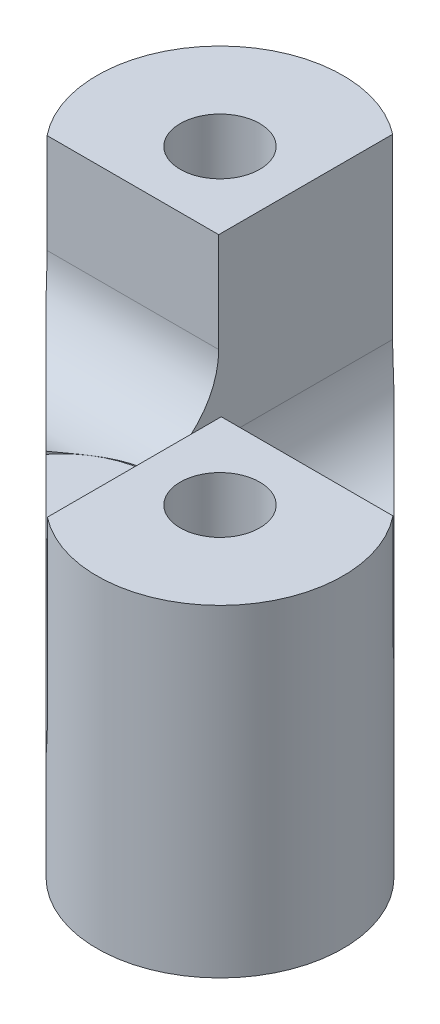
ISO-10303-21;
HEADER;
FILE_DESCRIPTION(('STEP AP214'),'2;1');
FILE_NAME('part.step','',(''),(''),'','','');
FILE_SCHEMA(('AUTOMOTIVE_DESIGN { 1 0 10303 214 1 1 1 1 }'));
ENDSEC;
DATA;
#1=APPLICATION_CONTEXT('core data for automotive mechanical design processes');
#2=APPLICATION_PROTOCOL_DEFINITION('international standard','automotive_design',2000,#1);
#3=PRODUCT_CONTEXT('',#1,'mechanical');
#4=PRODUCT('Part','Part','',(#3));
#5=PRODUCT_RELATED_PRODUCT_CATEGORY('part','',(#4));
#6=PRODUCT_DEFINITION_FORMATION('','',#4);
#7=PRODUCT_DEFINITION_CONTEXT('part definition',#1,'design');
#8=PRODUCT_DEFINITION('design','',#6,#7);
#9=PRODUCT_DEFINITION_SHAPE('','',#8);
#10=(LENGTH_UNIT() NAMED_UNIT(*) SI_UNIT(.MILLI.,.METRE.));
#11=(NAMED_UNIT(*) PLANE_ANGLE_UNIT() SI_UNIT($,.RADIAN.));
#12=(NAMED_UNIT(*) SI_UNIT($,.STERADIAN.) SOLID_ANGLE_UNIT());
#13=UNCERTAINTY_MEASURE_WITH_UNIT(LENGTH_MEASURE(1.E-05),#10,'distance_accuracy_value','');
#14=(GEOMETRIC_REPRESENTATION_CONTEXT(3) GLOBAL_UNCERTAINTY_ASSIGNED_CONTEXT((#13)) GLOBAL_UNIT_ASSIGNED_CONTEXT((#10,
#11,#12)) REPRESENTATION_CONTEXT('',''));
#15=CARTESIAN_POINT('',(0.,0.,0.));
#16=DIRECTION('',(0.,0.,1.));
#17=DIRECTION('',(1.,0.,0.));
#18=AXIS2_PLACEMENT_3D('',#15,#16,#17);
#19=CARTESIAN_POINT('',(0.,13.8,0.));
#20=DIRECTION('',(0.,1.,0.));
#21=DIRECTION('',(0.,0.,1.));
#22=AXIS2_PLACEMENT_3D('',#19,#20,#21);
#23=PLANE('',#22);
#24=CARTESIAN_POINT('',(-6.63999999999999,13.8,-6.63999999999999));
#25=DIRECTION('',(0.,1.,0.));
#26=DIRECTION('',(0.,0.,1.));
#27=AXIS2_PLACEMENT_3D('',#24,#25,#26);
#28=CIRCLE('',#27,1.7);
#29=CARTESIAN_POINT('',(-6.63999999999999,13.8,-8.33999999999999));
#30=VERTEX_POINT('',#29);
#31=EDGE_CURVE('E337',#30,#30,#28,.T.);
#32=ORIENTED_EDGE('',*,*,#31,.F.);
#33=EDGE_LOOP('',(#32));
#34=FACE_BOUND('',#33,.T.);
#35=CARTESIAN_POINT('',(-6.63999999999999,13.8,-6.63999999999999));
#36=DIRECTION('',(0.,1.,0.));
#37=DIRECTION('',(0.,0.,1.));
#38=AXIS2_PLACEMENT_3D('',#35,#36,#37);
#39=CIRCLE('',#38,5.26087445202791);
#40=CARTESIAN_POINT('',(-3.4,13.8,-10.7847798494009));
#41=VERTEX_POINT('',#40);
#42=CARTESIAN_POINT('',(-10.7410150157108,13.8,-3.34477984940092));
#43=VERTEX_POINT('',#42);
#44=EDGE_CURVE('E342',#41,#43,#39,.T.);
#45=ORIENTED_EDGE('',*,*,#44,.T.);
#46=DIRECTION('',(1.,0.,0.));
#47=VECTOR('',#46,1.);
#48=CARTESIAN_POINT('',(0.,13.8,-3.34477984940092));
#49=LINE('',#48,#47);
#50=CARTESIAN_POINT('',(-3.4,13.8,-3.34477984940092));
#51=VERTEX_POINT('',#50);
#52=EDGE_CURVE('E377',#43,#51,#49,.T.);
#53=ORIENTED_EDGE('',*,*,#52,.T.);
#54=DIRECTION('',(0.,0.,1.));
#55=VECTOR('',#54,1.);
#56=CARTESIAN_POINT('',(-3.4,13.8,0.));
#57=LINE('',#56,#55);
#58=EDGE_CURVE('E247',#41,#51,#57,.T.);
#59=ORIENTED_EDGE('',*,*,#58,.F.);
#60=EDGE_LOOP('',(#45,#53,#59));
#61=FACE_BOUND('',#60,.T.);
#62=ADVANCED_FACE('F45',(#34,#61),#23,.T.);
#63=CARTESIAN_POINT('',(3.4,20.8045031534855,-11.9008744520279));
#64=DIRECTION('',(1.,0.,0.));
#65=DIRECTION('',(0.,1.,0.));
#66=AXIS2_PLACEMENT_3D('',#63,#64,#65);
#67=PLANE('',#66);
#68=CARTESIAN_POINT('',(3.4,9.54477984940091,0.));
#69=DIRECTION('',(1.,0.,0.));
#70=DIRECTION('',(0.,1.,0.));
#71=AXIS2_PLACEMENT_3D('',#68,#69,#70);
#72=CIRCLE('',#71,3.34477984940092);
#73=CARTESIAN_POINT('',(3.4,9.54477984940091,3.34477984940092));
#74=VERTEX_POINT('',#73);
#75=CARTESIAN_POINT('',(3.4,6.26480442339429,0.655220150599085));
#76=VERTEX_POINT('',#75);
#77=EDGE_CURVE('E246',#74,#76,#72,.T.);
#78=ORIENTED_EDGE('',*,*,#77,.T.);
#79=DIRECTION('',(0.,1.,0.));
#80=VECTOR('',#79,1.);
#81=CARTESIAN_POINT('',(3.4,6.2,0.655220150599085));
#82=LINE('',#81,#80);
#83=CARTESIAN_POINT('',(3.4,6.2,0.655220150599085));
#84=VERTEX_POINT('',#83);
#85=EDGE_CURVE('E66',#76,#84,#82,.F.);
#86=ORIENTED_EDGE('',*,*,#85,.T.);
#87=DIRECTION('',(0.,0.,1.));
#88=VECTOR('',#87,1.);
#89=CARTESIAN_POINT('',(3.4,6.2,-11.9008744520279));
#90=LINE('',#89,#88);
#91=CARTESIAN_POINT('',(3.4,6.2,10.7847798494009));
#92=VERTEX_POINT('',#91);
#93=EDGE_CURVE('E211',#84,#92,#90,.T.);
#94=ORIENTED_EDGE('',*,*,#93,.T.);
#95=DIRECTION('',(0.,-1.,0.));
#96=VECTOR('',#95,1.);
#97=CARTESIAN_POINT('',(3.4,13.8,10.7847798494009));
#98=LINE('',#97,#96);
#99=CARTESIAN_POINT('',(3.4,13.8,10.7847798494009));
#100=VERTEX_POINT('',#99);
#101=EDGE_CURVE('E199',#92,#100,#98,.F.);
#102=ORIENTED_EDGE('',*,*,#101,.T.);
#103=DIRECTION('',(0.,0.,-1.));
#104=VECTOR('',#103,1.);
#105=CARTESIAN_POINT('',(3.4,13.8,0.));
#106=LINE('',#105,#104);
#107=CARTESIAN_POINT('',(3.4,13.8,3.34477984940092));
#108=VERTEX_POINT('',#107);
#109=EDGE_CURVE('E369',#100,#108,#106,.T.);
#110=ORIENTED_EDGE('',*,*,#109,.T.);
#111=DIRECTION('',(0.,-1.,0.));
#112=VECTOR('',#111,1.);
#113=CARTESIAN_POINT('',(3.4,20.8045031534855,3.34477984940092));
#114=LINE('',#113,#112);
#115=EDGE_CURVE('E288',#108,#74,#114,.T.);
#116=ORIENTED_EDGE('',*,*,#115,.T.);
#117=EDGE_LOOP('',(#78,#86,#94,#102,#110,#116));
#118=FACE_BOUND('',#117,.T.);
#119=ADVANCED_FACE('F233',(#118),#67,.F.);
#120=CARTESIAN_POINT('',(-3.71999999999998,13.8,3.71999999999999));
#121=DIRECTION('',(0.707106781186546,0.,-0.707106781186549));
#122=DIRECTION('',(-0.707106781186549,0.,-0.707106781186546));
#123=AXIS2_PLACEMENT_3D('',#120,#121,#122);
#124=PLANE('',#123);
#125=DIRECTION('',(0.707106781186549,0.,0.707106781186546));
#126=VECTOR('',#125,1.);
#127=CARTESIAN_POINT('',(-3.71999999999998,6.2,3.71999999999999));
#128=LINE('',#127,#126);
#129=CARTESIAN_POINT('',(-6.55459551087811,6.2,0.88540448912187));
#130=VERTEX_POINT('',#129);
#131=CARTESIAN_POINT('',(-3.4,6.2,4.03999999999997));
#132=VERTEX_POINT('',#131);
#133=EDGE_CURVE('E172',#130,#132,#128,.T.);
#134=ORIENTED_EDGE('',*,*,#133,.F.);
#135=DIRECTION('',(0.,1.,0.));
#136=VECTOR('',#135,1.);
#137=CARTESIAN_POINT('',(-6.55459551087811,6.2,0.88540448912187));
#138=LINE('',#137,#136);
#139=CARTESIAN_POINT('',(-6.55459551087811,6.31931691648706,0.885404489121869));
#140=VERTEX_POINT('',#139);
#141=EDGE_CURVE('E193',#130,#140,#138,.T.);
#142=ORIENTED_EDGE('',*,*,#141,.T.);
#143=CARTESIAN_POINT('',(-7.43999999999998,9.54477984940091,0.));
#144=DIRECTION('',(0.707106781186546,0.,-0.707106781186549));
#145=DIRECTION('',(0.707106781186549,0.,0.707106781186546));
#146=AXIS2_PLACEMENT_3D('',#143,#144,#145);
#147=ELLIPSE('',#146,4.73023302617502,3.34477984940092);
#148=CARTESIAN_POINT('',(-10.36,7.91347600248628,-2.91999999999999));
#149=VERTEX_POINT('',#148);
#150=EDGE_CURVE('E269',#140,#149,#147,.T.);
#151=ORIENTED_EDGE('',*,*,#150,.T.);
#152=DIRECTION('',(0.,-1.,0.));
#153=VECTOR('',#152,1.);
#154=CARTESIAN_POINT('',(-10.36,13.8,-2.91999999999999));
#155=LINE('',#154,#153);
#156=CARTESIAN_POINT('',(-10.36,0.,-2.91999999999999));
#157=VERTEX_POINT('',#156);
#158=EDGE_CURVE('E336',#149,#157,#155,.T.);
#159=ORIENTED_EDGE('',*,*,#158,.T.);
#160=DIRECTION('',(0.707106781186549,0.,0.707106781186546));
#161=VECTOR('',#160,1.);
#162=CARTESIAN_POINT('',(-3.71999999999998,0.,3.71999999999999));
#163=LINE('',#162,#161);
#164=CARTESIAN_POINT('',(2.92000000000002,0.,10.36));
#165=VERTEX_POINT('',#164);
#166=EDGE_CURVE('E346',#157,#165,#163,.T.);
#167=ORIENTED_EDGE('',*,*,#166,.T.);
#168=DIRECTION('',(0.,-1.,0.));
#169=VECTOR('',#168,1.);
#170=CARTESIAN_POINT('',(2.92000000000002,13.8,10.36));
#171=LINE('',#170,#169);
#172=CARTESIAN_POINT('',(2.92000000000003,4.45827671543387,10.36));
#173=VERTEX_POINT('',#172);
#174=EDGE_CURVE('E368',#173,#165,#171,.T.);
#175=ORIENTED_EDGE('',*,*,#174,.F.);
#176=CARTESIAN_POINT('',(0.,6.2,7.43999999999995));
#177=DIRECTION('',(0.707106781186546,0.,-0.707106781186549));
#178=DIRECTION('',(0.707106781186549,0.,0.707106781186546));
#179=AXIS2_PLACEMENT_3D('',#176,#177,#178);
#180=ELLIPSE('',#179,4.80832611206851,3.4);
#181=EDGE_CURVE('E223',#173,#132,#180,.T.);
#182=ORIENTED_EDGE('',*,*,#181,.T.);
#183=EDGE_LOOP('',(#134,#142,#151,#159,#167,#175,#182));
#184=FACE_BOUND('',#183,.T.);
#185=ADVANCED_FACE('F47',(#184),#124,.F.);
#186=CARTESIAN_POINT('',(6.64000000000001,13.8,6.63999999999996));
#187=DIRECTION('',(0.,-1.,0.));
#188=DIRECTION('',(0.,0.,-1.));
#189=AXIS2_PLACEMENT_3D('',#186,#187,#188);
#190=CYLINDRICAL_SURFACE('',#189,5.26087445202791);
#191=CARTESIAN_POINT('',(10.7410150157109,9.54477984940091,3.34477984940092));
#192=CARTESIAN_POINT('',(10.7410107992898,9.46982552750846,3.34479476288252));
#193=CARTESIAN_POINT('',(10.7389905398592,9.39487144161,3.34226097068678));
#194=CARTESIAN_POINT('',(10.7308864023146,9.24552323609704,3.33220228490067));
#195=CARTESIAN_POINT('',(10.7248027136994,9.17112909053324,3.32467762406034));
#196=CARTESIAN_POINT('',(10.7087642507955,9.0254878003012,3.30501813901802));
#197=CARTESIAN_POINT('',(10.6989207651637,8.95421042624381,3.29301606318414));
#198=CARTESIAN_POINT('',(10.6753104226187,8.81321013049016,3.26458693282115));
#199=CARTESIAN_POINT('',(10.6615438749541,8.7434870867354,3.24816022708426));
#200=CARTESIAN_POINT('',(10.6302555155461,8.60705840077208,3.21140938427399));
#201=CARTESIAN_POINT('',(10.612790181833,8.54032387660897,3.19114430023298));
#202=CARTESIAN_POINT('',(10.5739400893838,8.40926735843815,3.1468951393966));
#203=CARTESIAN_POINT('',(10.5525550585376,8.34494553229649,3.12291080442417));
#204=CARTESIAN_POINT('',(10.5051742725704,8.21736987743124,3.07089646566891));
#205=CARTESIAN_POINT('',(10.4790663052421,8.15419621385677,3.04277208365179));
#206=CARTESIAN_POINT('',(10.4226690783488,8.03121612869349,2.98351508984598));
#207=CARTESIAN_POINT('',(10.3923798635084,7.97140967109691,2.95238251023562));
#208=CARTESIAN_POINT('',(10.36,7.91347600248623,2.91999999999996));
#209=B_SPLINE_CURVE_WITH_KNOTS('',3,(#191,#192,#193,#194,#195,#196,#197,#198,#199,#200,#201,
#202,#203,#204,#205,#206,#207,#208),.UNSPECIFIED.,.F.,.F.,(4,2,2,2,2,2,2,2,4),(0.,
0.2247932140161,0.449575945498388,0.668164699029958,0.886736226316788,1.1021841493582,
1.31764703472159,1.53913516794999,1.76062093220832),.UNSPECIFIED.);
#210=CARTESIAN_POINT('',(10.7410150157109,9.54477984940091,3.34477984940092));
#211=VERTEX_POINT('',#210);
#212=CARTESIAN_POINT('',(10.36,7.91347600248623,2.91999999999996));
#213=VERTEX_POINT('',#212);
#214=EDGE_CURVE('E205',#211,#213,#209,.T.);
#215=ORIENTED_EDGE('',*,*,#214,.F.);
#216=DIRECTION('',(0.,-1.,0.));
#217=VECTOR('',#216,1.);
#218=CARTESIAN_POINT('',(10.7410150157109,13.8,3.34477984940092));
#219=LINE('',#218,#217);
#220=CARTESIAN_POINT('',(10.7410150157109,13.8,3.34477984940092));
#221=VERTEX_POINT('',#220);
#222=EDGE_CURVE('E386',#221,#211,#219,.T.);
#223=ORIENTED_EDGE('',*,*,#222,.F.);
#224=CARTESIAN_POINT('',(6.64000000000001,13.8,6.63999999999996));
#225=DIRECTION('',(0.,1.,0.));
#226=DIRECTION('',(0.,0.,1.));
#227=AXIS2_PLACEMENT_3D('',#224,#225,#226);
#228=CIRCLE('',#227,5.26087445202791);
#229=EDGE_CURVE('E363',#221,#100,#228,.F.);
#230=ORIENTED_EDGE('',*,*,#229,.T.);
#231=ORIENTED_EDGE('',*,*,#101,.F.);
#232=CARTESIAN_POINT('',(2.92000000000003,4.45827671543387,10.36));
#233=CARTESIAN_POINT('',(2.95512823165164,4.51713729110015,10.3951267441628));
#234=CARTESIAN_POINT('',(2.98903317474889,4.57805637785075,10.4280376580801));
#235=CARTESIAN_POINT('',(3.05381738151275,4.70361760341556,10.4894271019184));
#236=CARTESIAN_POINT('',(3.08469678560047,4.76825956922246,10.5179058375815));
#237=CARTESIAN_POINT('',(3.14201297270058,4.89895988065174,10.5696736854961));
#238=CARTESIAN_POINT('',(3.16855243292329,4.96492315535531,10.5930890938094));
#239=CARTESIAN_POINT('',(3.21778980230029,5.09956130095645,10.635790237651));
#240=CARTESIAN_POINT('',(3.24048780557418,5.16823610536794,10.655076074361));
#241=CARTESIAN_POINT('',(3.2832909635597,5.31334183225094,10.6909439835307));
#242=CARTESIAN_POINT('',(3.30305077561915,5.38995746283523,10.7071931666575));
#243=CARTESIAN_POINT('',(3.33729732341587,5.5451954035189,10.7350505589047));
#244=CARTESIAN_POINT('',(3.35178323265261,5.62381802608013,10.7466580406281));
#245=CARTESIAN_POINT('',(3.3755863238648,5.78496817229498,10.7656098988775));
#246=CARTESIAN_POINT('',(3.38472260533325,5.86754001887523,10.7728054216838));
#247=CARTESIAN_POINT('',(3.39693995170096,6.03340791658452,10.7823870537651));
#248=CARTESIAN_POINT('',(3.40002097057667,6.11670397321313,10.7847731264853));
#249=CARTESIAN_POINT('',(3.40000000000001,6.19999999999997,10.7847798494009));
#250=B_SPLINE_CURVE_WITH_KNOTS('',3,(#232,#233,#234,#235,#236,#237,#238,#239,#240,#241,#242,
#243,#244,#245,#246,#247,#248,#249),.UNSPECIFIED.,.F.,.F.,(4,2,2,2,2,2,2,2,4),(0.,
0.231007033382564,0.46200334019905,0.686317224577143,0.910625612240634,1.15261256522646,
1.3946374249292,1.64443358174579,1.89423163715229),.UNSPECIFIED.);
#251=EDGE_CURVE('E216',#173,#92,#250,.T.);
#252=ORIENTED_EDGE('',*,*,#251,.F.);
#253=ORIENTED_EDGE('',*,*,#174,.T.);
#254=CARTESIAN_POINT('',(6.64000000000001,0.,6.63999999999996));
#255=DIRECTION('',(0.,1.,0.));
#256=DIRECTION('',(0.,0.,1.));
#257=AXIS2_PLACEMENT_3D('',#254,#255,#256);
#258=CIRCLE('',#257,5.26087445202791);
#259=CARTESIAN_POINT('',(10.36,0.,2.91999999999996));
#260=VERTEX_POINT('',#259);
#261=EDGE_CURVE('E349',#260,#165,#258,.F.);
#262=ORIENTED_EDGE('',*,*,#261,.F.);
#263=DIRECTION('',(0.,-1.,0.));
#264=VECTOR('',#263,1.);
#265=CARTESIAN_POINT('',(10.36,13.8,2.91999999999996));
#266=LINE('',#265,#264);
#267=EDGE_CURVE('E366',#213,#260,#266,.T.);
#268=ORIENTED_EDGE('',*,*,#267,.F.);
#269=EDGE_LOOP('',(#215,#223,#230,#231,#252,#253,#262,#268));
#270=FACE_BOUND('',#269,.T.);
#271=ADVANCED_FACE('F225',(#270),#190,.T.);
#272=CARTESIAN_POINT('',(3.72,13.8,-3.72000000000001));
#273=DIRECTION('',(0.707106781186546,0.,-0.707106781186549));
#274=DIRECTION('',(-0.707106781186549,0.,-0.707106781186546));
#275=AXIS2_PLACEMENT_3D('',#272,#273,#274);
#276=PLANE('',#275);
#277=DIRECTION('',(0.,1.,0.));
#278=VECTOR('',#277,1.);
#279=CARTESIAN_POINT('',(6.55459551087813,6.2,-0.885404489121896));
#280=LINE('',#279,#278);
#281=CARTESIAN_POINT('',(6.55459551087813,6.31931691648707,-0.885404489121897));
#282=VERTEX_POINT('',#281);
#283=CARTESIAN_POINT('',(6.55459551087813,6.2,-0.885404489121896));
#284=VERTEX_POINT('',#283);
#285=EDGE_CURVE('E405',#282,#284,#280,.F.);
#286=ORIENTED_EDGE('',*,*,#285,.F.);
#287=CARTESIAN_POINT('',(7.44000000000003,9.54477984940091,0.));
#288=DIRECTION('',(0.707106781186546,0.,-0.707106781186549));
#289=DIRECTION('',(0.707106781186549,0.,0.707106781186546));
#290=AXIS2_PLACEMENT_3D('',#287,#288,#289);
#291=ELLIPSE('',#290,4.73023302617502,3.34477984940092);
#292=EDGE_CURVE('E403',#213,#282,#291,.T.);
#293=ORIENTED_EDGE('',*,*,#292,.F.);
#294=ORIENTED_EDGE('',*,*,#267,.T.);
#295=DIRECTION('',(0.707106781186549,0.,0.707106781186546));
#296=VECTOR('',#295,1.);
#297=CARTESIAN_POINT('',(3.72,0.,-3.72000000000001));
#298=LINE('',#297,#296);
#299=CARTESIAN_POINT('',(-2.92,0.,-10.36));
#300=VERTEX_POINT('',#299);
#301=EDGE_CURVE('E352',#300,#260,#298,.T.);
#302=ORIENTED_EDGE('',*,*,#301,.F.);
#303=DIRECTION('',(0.,-1.,0.));
#304=VECTOR('',#303,1.);
#305=CARTESIAN_POINT('',(-2.92,13.8,-10.36));
#306=LINE('',#305,#304);
#307=CARTESIAN_POINT('',(-2.92,4.45827671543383,-10.36));
#308=VERTEX_POINT('',#307);
#309=EDGE_CURVE('E339',#308,#300,#306,.T.);
#310=ORIENTED_EDGE('',*,*,#309,.F.);
#311=CARTESIAN_POINT('',(0.,6.2,-7.44));
#312=DIRECTION('',(0.707106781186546,0.,-0.707106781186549));
#313=DIRECTION('',(0.707106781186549,0.,0.707106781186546));
#314=AXIS2_PLACEMENT_3D('',#311,#312,#313);
#315=ELLIPSE('',#314,4.80832611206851,3.4);
#316=CARTESIAN_POINT('',(3.4,6.2,-4.04000000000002));
#317=VERTEX_POINT('',#316);
#318=EDGE_CURVE('E214',#317,#308,#315,.T.);
#319=ORIENTED_EDGE('',*,*,#318,.F.);
#320=DIRECTION('',(0.707106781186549,0.,0.707106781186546));
#321=VECTOR('',#320,1.);
#322=CARTESIAN_POINT('',(3.72,6.2,-3.72000000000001));
#323=LINE('',#322,#321);
#324=EDGE_CURVE('E412',#317,#284,#323,.T.);
#325=ORIENTED_EDGE('',*,*,#324,.T.);
#326=EDGE_LOOP('',(#286,#293,#294,#302,#310,#319,#325));
#327=FACE_BOUND('',#326,.T.);
#328=ADVANCED_FACE('F258',(#327),#276,.T.);
#329=CARTESIAN_POINT('',(-6.63999999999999,13.8,-6.63999999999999));
#330=DIRECTION('',(0.,-1.,0.));
#331=DIRECTION('',(0.,0.,-1.));
#332=AXIS2_PLACEMENT_3D('',#329,#330,#331);
#333=CYLINDRICAL_SURFACE('',#332,1.7);
#334=CARTESIAN_POINT('',(-6.63999999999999,0.,-6.63999999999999));
#335=DIRECTION('',(0.,1.,0.));
#336=DIRECTION('',(0.,0.,1.));
#337=AXIS2_PLACEMENT_3D('',#334,#335,#336);
#338=CIRCLE('',#337,1.7);
#339=CARTESIAN_POINT('',(-6.63999999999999,0.,-8.33999999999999));
#340=VERTEX_POINT('',#339);
#341=EDGE_CURVE('E358',#340,#340,#338,.T.);
#342=CARTESIAN_POINT('',(-6.63999999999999,13.8,-8.33999999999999));
#343=CARTESIAN_POINT('',(-6.63999999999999,13.65625,-8.33999999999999));
#344=CARTESIAN_POINT('',(-6.63999999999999,13.5125,-8.33999999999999));
#345=CARTESIAN_POINT('',(-6.63999999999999,13.225,-8.33999999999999));
#346=CARTESIAN_POINT('',(-6.63999999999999,13.08125,-8.33999999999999));
#347=CARTESIAN_POINT('',(-6.63999999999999,12.79375,-8.33999999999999));
#348=CARTESIAN_POINT('',(-6.63999999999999,12.65,-8.33999999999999));
#349=CARTESIAN_POINT('',(-6.63999999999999,12.3625,-8.33999999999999));
#350=CARTESIAN_POINT('',(-6.63999999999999,12.21875,-8.33999999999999));
#351=CARTESIAN_POINT('',(-6.63999999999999,11.93125,-8.33999999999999));
#352=CARTESIAN_POINT('',(-6.63999999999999,11.7875,-8.33999999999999));
#353=CARTESIAN_POINT('',(-6.63999999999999,11.5,-8.33999999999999));
#354=CARTESIAN_POINT('',(-6.63999999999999,11.35625,-8.33999999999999));
#355=CARTESIAN_POINT('',(-6.63999999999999,11.06875,-8.33999999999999));
#356=CARTESIAN_POINT('',(-6.63999999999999,10.925,-8.33999999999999));
#357=CARTESIAN_POINT('',(-6.63999999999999,10.6375,-8.33999999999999));
#358=CARTESIAN_POINT('',(-6.63999999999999,10.49375,-8.33999999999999));
#359=CARTESIAN_POINT('',(-6.63999999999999,10.20625,-8.33999999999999));
#360=CARTESIAN_POINT('',(-6.63999999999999,10.0625,-8.33999999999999));
#361=CARTESIAN_POINT('',(-6.63999999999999,9.775,-8.33999999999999));
#362=CARTESIAN_POINT('',(-6.63999999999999,9.63125,-8.33999999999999));
#363=CARTESIAN_POINT('',(-6.63999999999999,9.34375,-8.33999999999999));
#364=CARTESIAN_POINT('',(-6.63999999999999,9.2,-8.33999999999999));
#365=CARTESIAN_POINT('',(-6.63999999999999,8.9125,-8.33999999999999));
#366=CARTESIAN_POINT('',(-6.63999999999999,8.76875,-8.33999999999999));
#367=CARTESIAN_POINT('',(-6.63999999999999,8.48125,-8.33999999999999));
#368=CARTESIAN_POINT('',(-6.63999999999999,8.3375,-8.33999999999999));
#369=CARTESIAN_POINT('',(-6.63999999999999,8.05,-8.33999999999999));
#370=CARTESIAN_POINT('',(-6.63999999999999,7.90625,-8.33999999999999));
#371=CARTESIAN_POINT('',(-6.63999999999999,7.61875,-8.33999999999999));
#372=CARTESIAN_POINT('',(-6.63999999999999,7.475,-8.33999999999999));
#373=CARTESIAN_POINT('',(-6.63999999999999,7.1875,-8.33999999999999));
#374=CARTESIAN_POINT('',(-6.63999999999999,7.04375,-8.33999999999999));
#375=CARTESIAN_POINT('',(-6.63999999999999,6.75625,-8.33999999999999));
#376=CARTESIAN_POINT('',(-6.63999999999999,6.6125,-8.33999999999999));
#377=CARTESIAN_POINT('',(-6.63999999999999,6.325,-8.33999999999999));
#378=CARTESIAN_POINT('',(-6.63999999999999,6.18125,-8.33999999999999));
#379=CARTESIAN_POINT('',(-6.63999999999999,5.89375,-8.33999999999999));
#380=CARTESIAN_POINT('',(-6.63999999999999,5.75,-8.33999999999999));
#381=CARTESIAN_POINT('',(-6.63999999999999,5.4625,-8.33999999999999));
#382=CARTESIAN_POINT('',(-6.63999999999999,5.31875,-8.33999999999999));
#383=CARTESIAN_POINT('',(-6.63999999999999,5.03125,-8.33999999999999));
#384=CARTESIAN_POINT('',(-6.63999999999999,4.8875,-8.33999999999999));
#385=CARTESIAN_POINT('',(-6.63999999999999,4.6,-8.33999999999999));
#386=CARTESIAN_POINT('',(-6.63999999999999,4.45625,-8.33999999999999));
#387=CARTESIAN_POINT('',(-6.63999999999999,4.16875,-8.33999999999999));
#388=CARTESIAN_POINT('',(-6.63999999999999,4.025,-8.33999999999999));
#389=CARTESIAN_POINT('',(-6.63999999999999,3.7375,-8.33999999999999));
#390=CARTESIAN_POINT('',(-6.63999999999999,3.59375,-8.33999999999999));
#391=CARTESIAN_POINT('',(-6.63999999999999,3.30625,-8.33999999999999));
#392=CARTESIAN_POINT('',(-6.63999999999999,3.1625,-8.33999999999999));
#393=CARTESIAN_POINT('',(-6.63999999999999,2.875,-8.33999999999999));
#394=CARTESIAN_POINT('',(-6.63999999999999,2.73125,-8.33999999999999));
#395=CARTESIAN_POINT('',(-6.63999999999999,2.44375,-8.33999999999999));
#396=CARTESIAN_POINT('',(-6.63999999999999,2.3,-8.33999999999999));
#397=CARTESIAN_POINT('',(-6.63999999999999,2.0125,-8.33999999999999));
#398=CARTESIAN_POINT('',(-6.63999999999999,1.86875,-8.33999999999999));
#399=CARTESIAN_POINT('',(-6.63999999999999,1.58125,-8.33999999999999));
#400=CARTESIAN_POINT('',(-6.63999999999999,1.4375,-8.33999999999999));
#401=CARTESIAN_POINT('',(-6.63999999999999,1.15,-8.33999999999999));
#402=CARTESIAN_POINT('',(-6.63999999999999,1.00625,-8.33999999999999));
#403=CARTESIAN_POINT('',(-6.63999999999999,0.71875,-8.33999999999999));
#404=CARTESIAN_POINT('',(-6.63999999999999,0.575,-8.33999999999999));
#405=CARTESIAN_POINT('',(-6.63999999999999,0.2875,-8.33999999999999));
#406=CARTESIAN_POINT('',(-6.63999999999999,0.14375,-8.33999999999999));
#407=CARTESIAN_POINT('',(-6.63999999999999,0.,-8.33999999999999));
#408=B_SPLINE_CURVE_WITH_KNOTS('',3,(#342,#343,#344,#345,#346,#347,#348,#349,#350,#351,#352,
#353,#354,#355,#356,#357,#358,#359,#360,#361,#362,#363,#364,#365,#366,#367,#368,#369,#370,#371,
#372,#373,#374,#375,#376,#377,#378,#379,#380,#381,#382,#383,#384,#385,#386,#387,#388,#389,#390,
#391,#392,#393,#394,#395,#396,#397,#398,#399,#400,#401,#402,#403,#404,#405,#406,#407),
.UNSPECIFIED.,.F.,.F.,(4,2,2,2,2,2,2,2,2,2,2,2,2,2,2,2,2,2,2,2,2,2,2,2,2,2,2,2,2,2,2,2,4),(0.,
0.431249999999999,0.862499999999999,1.29375,1.725,2.15625,2.5875,3.01875,3.45,3.88125,4.3125,
4.74375,5.175,5.60625,6.0375,6.46875,6.9,7.33125,7.7625,8.19375,8.625,9.05625,9.4875,9.91875,
10.35,10.78125,11.2125,11.64375,12.075,12.50625,12.9375,13.36875,13.8),.UNSPECIFIED.);
#409=EDGE_CURVE('BSEAM255',#30,#340,#408,.T.);
#410=ORIENTED_EDGE('',*,*,#31,.T.);
#411=ORIENTED_EDGE('',*,*,#341,.F.);
#412=ORIENTED_EDGE('',*,*,#409,.T.);
#413=ORIENTED_EDGE('',*,*,#409,.F.);
#414=EDGE_LOOP('',(#410,#412,#411,#413));
#415=FACE_BOUND('',#414,.T.);
#416=ADVANCED_FACE('F255',(#415),#333,.F.);
#417=CARTESIAN_POINT('',(-6.63999999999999,13.8,-6.63999999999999));
#418=DIRECTION('',(0.,-1.,0.));
#419=DIRECTION('',(0.,0.,-1.));
#420=AXIS2_PLACEMENT_3D('',#417,#418,#419);
#421=CYLINDRICAL_SURFACE('',#420,5.26087445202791);
#422=ORIENTED_EDGE('',*,*,#158,.F.);
#423=CARTESIAN_POINT('',(-10.36,7.91347600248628,-2.91999999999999));
#424=CARTESIAN_POINT('',(-10.3928825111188,7.97230782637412,-2.95288540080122));
#425=CARTESIAN_POINT('',(-10.4236085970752,8.0330718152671,-2.98448110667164));
#426=CARTESIAN_POINT('',(-10.480749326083,8.15806758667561,-3.04456266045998));
#427=CARTESIAN_POINT('',(-10.5071638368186,8.22229947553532,-3.0730484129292));
#428=CARTESIAN_POINT('',(-10.5550111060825,8.35201527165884,-3.12564138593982));
#429=CARTESIAN_POINT('',(-10.5765612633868,8.41741566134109,-3.14984777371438));
#430=CARTESIAN_POINT('',(-10.6156240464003,8.55068101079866,-3.19440975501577));
#431=CARTESIAN_POINT('',(-10.6331370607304,8.61854573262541,-3.21476571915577));
#432=CARTESIAN_POINT('',(-10.6639416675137,8.75521941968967,-3.25101027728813));
#433=CARTESIAN_POINT('',(-10.6772942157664,8.82399766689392,-3.26696294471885));
#434=CARTESIAN_POINT('',(-10.7001947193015,8.96303908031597,-3.29456453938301));
#435=CARTESIAN_POINT('',(-10.7097424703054,9.03330232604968,-3.30621323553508));
#436=CARTESIAN_POINT('',(-10.7252952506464,9.17680956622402,-3.32528615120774));
#437=CARTESIAN_POINT('',(-10.7311939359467,9.25008201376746,-3.33258335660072));
#438=CARTESIAN_POINT('',(-10.7390519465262,9.3971628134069,-3.34233735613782));
#439=CARTESIAN_POINT('',(-10.7410110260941,9.47097119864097,-3.34479384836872));
#440=CARTESIAN_POINT('',(-10.7410150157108,9.54477984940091,-3.34477984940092));
#441=B_SPLINE_CURVE_WITH_KNOTS('',3,(#423,#424,#425,#426,#427,#428,#429,#430,#431,#432,#433,
#434,#435,#436,#437,#438,#439,#440),.UNSPECIFIED.,.F.,.F.,(4,2,2,2,2,2,2,2,4),(0.,
0.224919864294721,0.449846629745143,0.668563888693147,0.887260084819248,1.10258246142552,
1.31791639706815,1.53926184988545,1.76062110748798),.UNSPECIFIED.);
#442=CARTESIAN_POINT('',(-10.7410150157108,9.54477984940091,-3.34477984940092));
#443=VERTEX_POINT('',#442);
#444=EDGE_CURVE('E261',#149,#443,#441,.T.);
#445=ORIENTED_EDGE('',*,*,#444,.T.);
#446=DIRECTION('',(0.,-1.,0.));
#447=VECTOR('',#446,1.);
#448=CARTESIAN_POINT('',(-10.7410150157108,13.8,-3.34477984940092));
#449=LINE('',#448,#447);
#450=EDGE_CURVE('E380',#43,#443,#449,.T.);
#451=ORIENTED_EDGE('',*,*,#450,.F.);
#452=ORIENTED_EDGE('',*,*,#44,.F.);
#453=DIRECTION('',(0.,-1.,0.));
#454=VECTOR('',#453,1.);
#455=CARTESIAN_POINT('',(-3.4,13.8,-10.7847798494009));
#456=LINE('',#455,#454);
#457=CARTESIAN_POINT('',(-3.4,6.2,-10.7847798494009));
#458=VERTEX_POINT('',#457);
#459=EDGE_CURVE('E201',#41,#458,#456,.T.);
#460=ORIENTED_EDGE('',*,*,#459,.T.);
#461=CARTESIAN_POINT('',(-3.4,6.2,-10.7847798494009));
#462=CARTESIAN_POINT('',(-3.4000151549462,6.12302503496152,-10.7847747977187));
#463=CARTESIAN_POINT('',(-3.39738659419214,6.04605028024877,-10.7827363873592));
#464=CARTESIAN_POINT('',(-3.38695047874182,5.89267920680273,-10.7745556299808));
#465=CARTESIAN_POINT('',(-3.37914341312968,5.8162828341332,-10.7684136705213));
#466=CARTESIAN_POINT('',(-3.35875749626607,5.66682251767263,-10.7522258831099));
#467=CARTESIAN_POINT('',(-3.34632302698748,5.59372606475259,-10.7422979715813));
#468=CARTESIAN_POINT('',(-3.31686989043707,5.44912245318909,-10.718476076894));
#469=CARTESIAN_POINT('',(-3.29985128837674,5.37761527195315,-10.7045821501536));
#470=CARTESIAN_POINT('',(-3.25995741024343,5.23103221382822,-10.6714806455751));
#471=CARTESIAN_POINT('',(-3.2367219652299,5.15612988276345,-10.6519363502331));
#472=CARTESIAN_POINT('',(-3.18565339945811,5.00934675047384,-10.6080501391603));
#473=CARTESIAN_POINT('',(-3.15781948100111,4.93746647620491,-10.5837073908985));
#474=CARTESIAN_POINT('',(-3.09713548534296,4.7950358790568,-10.5292961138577));
#475=CARTESIAN_POINT('',(-3.06415280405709,4.72460280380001,-10.4990685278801));
#476=CARTESIAN_POINT('',(-2.99459222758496,4.5880668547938,-10.4334262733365));
#477=CARTESIAN_POINT('',(-2.95801453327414,4.52196373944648,-10.3980118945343));
#478=CARTESIAN_POINT('',(-2.92,4.45827671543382,-10.36));
#479=B_SPLINE_CURVE_WITH_KNOTS('',3,(#461,#462,#463,#464,#465,#466,#467,#468,#469,#470,#471,
#472,#473,#474,#475,#476,#477,#478),.UNSPECIFIED.,.F.,.F.,(4,2,2,2,2,2,2,2,4),(0.,
0.230853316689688,0.46168483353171,0.685847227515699,0.910006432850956,1.15213804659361,
1.39431170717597,1.64427908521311,1.89423250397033),.UNSPECIFIED.);
#480=EDGE_CURVE('E198',#458,#308,#479,.T.);
#481=ORIENTED_EDGE('',*,*,#480,.T.);
#482=ORIENTED_EDGE('',*,*,#309,.T.);
#483=CARTESIAN_POINT('',(-6.63999999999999,0.,-6.63999999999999));
#484=DIRECTION('',(0.,1.,0.));
#485=DIRECTION('',(0.,0.,1.));
#486=AXIS2_PLACEMENT_3D('',#483,#484,#485);
#487=CIRCLE('',#486,5.26087445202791);
#488=EDGE_CURVE('E355',#300,#157,#487,.T.);
#489=ORIENTED_EDGE('',*,*,#488,.T.);
#490=EDGE_LOOP('',(#422,#445,#451,#452,#460,#481,#482,#489));
#491=FACE_BOUND('',#490,.T.);
#492=ADVANCED_FACE('F250',(#491),#421,.T.);
#493=CARTESIAN_POINT('',(6.64000000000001,13.8,6.63999999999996));
#494=DIRECTION('',(0.,-1.,0.));
#495=DIRECTION('',(0.,0.,-1.));
#496=AXIS2_PLACEMENT_3D('',#493,#494,#495);
#497=CYLINDRICAL_SURFACE('',#496,1.7);
#498=CARTESIAN_POINT('',(6.64000000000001,13.8,6.63999999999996));
#499=DIRECTION('',(0.,1.,0.));
#500=DIRECTION('',(0.,0.,1.));
#501=AXIS2_PLACEMENT_3D('',#498,#499,#500);
#502=CIRCLE('',#501,1.7);
#503=CARTESIAN_POINT('',(6.64000000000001,13.8,4.93999999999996));
#504=VERTEX_POINT('',#503);
#505=EDGE_CURVE('E335',#504,#504,#502,.F.);
#506=CARTESIAN_POINT('',(6.64000000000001,0.,6.63999999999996));
#507=DIRECTION('',(0.,1.,0.));
#508=DIRECTION('',(0.,0.,1.));
#509=AXIS2_PLACEMENT_3D('',#506,#507,#508);
#510=CIRCLE('',#509,1.7);
#511=CARTESIAN_POINT('',(6.64000000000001,0.,4.93999999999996));
#512=VERTEX_POINT('',#511);
#513=EDGE_CURVE('E361',#512,#512,#510,.F.);
#514=CARTESIAN_POINT('',(6.64000000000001,13.8,4.93999999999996));
#515=CARTESIAN_POINT('',(6.64000000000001,13.65625,4.93999999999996));
#516=CARTESIAN_POINT('',(6.64000000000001,13.5125,4.93999999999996));
#517=CARTESIAN_POINT('',(6.64000000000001,13.225,4.93999999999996));
#518=CARTESIAN_POINT('',(6.64000000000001,13.08125,4.93999999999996));
#519=CARTESIAN_POINT('',(6.64000000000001,12.79375,4.93999999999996));
#520=CARTESIAN_POINT('',(6.64000000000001,12.65,4.93999999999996));
#521=CARTESIAN_POINT('',(6.64000000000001,12.3625,4.93999999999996));
#522=CARTESIAN_POINT('',(6.64000000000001,12.21875,4.93999999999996));
#523=CARTESIAN_POINT('',(6.64000000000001,11.93125,4.93999999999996));
#524=CARTESIAN_POINT('',(6.64000000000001,11.7875,4.93999999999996));
#525=CARTESIAN_POINT('',(6.64000000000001,11.5,4.93999999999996));
#526=CARTESIAN_POINT('',(6.64000000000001,11.35625,4.93999999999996));
#527=CARTESIAN_POINT('',(6.64000000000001,11.06875,4.93999999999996));
#528=CARTESIAN_POINT('',(6.64000000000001,10.925,4.93999999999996));
#529=CARTESIAN_POINT('',(6.64000000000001,10.6375,4.93999999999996));
#530=CARTESIAN_POINT('',(6.64000000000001,10.49375,4.93999999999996));
#531=CARTESIAN_POINT('',(6.64000000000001,10.20625,4.93999999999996));
#532=CARTESIAN_POINT('',(6.64000000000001,10.0625,4.93999999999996));
#533=CARTESIAN_POINT('',(6.64000000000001,9.775,4.93999999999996));
#534=CARTESIAN_POINT('',(6.64000000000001,9.63125,4.93999999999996));
#535=CARTESIAN_POINT('',(6.64000000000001,9.34375,4.93999999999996));
#536=CARTESIAN_POINT('',(6.64000000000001,9.2,4.93999999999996));
#537=CARTESIAN_POINT('',(6.64000000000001,8.9125,4.93999999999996));
#538=CARTESIAN_POINT('',(6.64000000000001,8.76875,4.93999999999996));
#539=CARTESIAN_POINT('',(6.64000000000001,8.48125,4.93999999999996));
#540=CARTESIAN_POINT('',(6.64000000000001,8.3375,4.93999999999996));
#541=CARTESIAN_POINT('',(6.64000000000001,8.05,4.93999999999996));
#542=CARTESIAN_POINT('',(6.64000000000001,7.90625,4.93999999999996));
#543=CARTESIAN_POINT('',(6.64000000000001,7.61875,4.93999999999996));
#544=CARTESIAN_POINT('',(6.64000000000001,7.475,4.93999999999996));
#545=CARTESIAN_POINT('',(6.64000000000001,7.1875,4.93999999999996));
#546=CARTESIAN_POINT('',(6.64000000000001,7.04375,4.93999999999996));
#547=CARTESIAN_POINT('',(6.64000000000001,6.75625,4.93999999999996));
#548=CARTESIAN_POINT('',(6.64000000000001,6.6125,4.93999999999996));
#549=CARTESIAN_POINT('',(6.64000000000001,6.325,4.93999999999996));
#550=CARTESIAN_POINT('',(6.64000000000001,6.18125,4.93999999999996));
#551=CARTESIAN_POINT('',(6.64000000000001,5.89375,4.93999999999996));
#552=CARTESIAN_POINT('',(6.64000000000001,5.75,4.93999999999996));
#553=CARTESIAN_POINT('',(6.64000000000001,5.4625,4.93999999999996));
#554=CARTESIAN_POINT('',(6.64000000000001,5.31875,4.93999999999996));
#555=CARTESIAN_POINT('',(6.64000000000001,5.03125,4.93999999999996));
#556=CARTESIAN_POINT('',(6.64000000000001,4.8875,4.93999999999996));
#557=CARTESIAN_POINT('',(6.64000000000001,4.6,4.93999999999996));
#558=CARTESIAN_POINT('',(6.64000000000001,4.45625,4.93999999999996));
#559=CARTESIAN_POINT('',(6.64000000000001,4.16875,4.93999999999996));
#560=CARTESIAN_POINT('',(6.64000000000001,4.025,4.93999999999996));
#561=CARTESIAN_POINT('',(6.64000000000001,3.7375,4.93999999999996));
#562=CARTESIAN_POINT('',(6.64000000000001,3.59375,4.93999999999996));
#563=CARTESIAN_POINT('',(6.64000000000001,3.30625,4.93999999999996));
#564=CARTESIAN_POINT('',(6.64000000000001,3.1625,4.93999999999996));
#565=CARTESIAN_POINT('',(6.64000000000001,2.875,4.93999999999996));
#566=CARTESIAN_POINT('',(6.64000000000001,2.73125,4.93999999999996));
#567=CARTESIAN_POINT('',(6.64000000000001,2.44375,4.93999999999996));
#568=CARTESIAN_POINT('',(6.64000000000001,2.3,4.93999999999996));
#569=CARTESIAN_POINT('',(6.64000000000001,2.0125,4.93999999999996));
#570=CARTESIAN_POINT('',(6.64000000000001,1.86875,4.93999999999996));
#571=CARTESIAN_POINT('',(6.64000000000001,1.58125,4.93999999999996));
#572=CARTESIAN_POINT('',(6.64000000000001,1.4375,4.93999999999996));
#573=CARTESIAN_POINT('',(6.64000000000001,1.15,4.93999999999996));
#574=CARTESIAN_POINT('',(6.64000000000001,1.00625,4.93999999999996));
#575=CARTESIAN_POINT('',(6.64000000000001,0.71875,4.93999999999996));
#576=CARTESIAN_POINT('',(6.64000000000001,0.575,4.93999999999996));
#577=CARTESIAN_POINT('',(6.64000000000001,0.2875,4.93999999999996));
#578=CARTESIAN_POINT('',(6.64000000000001,0.14375,4.93999999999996));
#579=CARTESIAN_POINT('',(6.64000000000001,0.,4.93999999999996));
#580=B_SPLINE_CURVE_WITH_KNOTS('',3,(#514,#515,#516,#517,#518,#519,#520,#521,#522,#523,#524,
#525,#526,#527,#528,#529,#530,#531,#532,#533,#534,#535,#536,#537,#538,#539,#540,#541,#542,#543,
#544,#545,#546,#547,#548,#549,#550,#551,#552,#553,#554,#555,#556,#557,#558,#559,#560,#561,#562,
#563,#564,#565,#566,#567,#568,#569,#570,#571,#572,#573,#574,#575,#576,#577,#578,#579),
.UNSPECIFIED.,.F.,.F.,(4,2,2,2,2,2,2,2,2,2,2,2,2,2,2,2,2,2,2,2,2,2,2,2,2,2,2,2,2,2,2,2,4),(0.,
0.431249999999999,0.862499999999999,1.29375,1.725,2.15625,2.5875,3.01875,3.45,3.88125,4.3125,
4.74375,5.175,5.60625,6.0375,6.46875,6.9,7.33125,7.7625,8.19375,8.625,9.05625,9.4875,9.91875,
10.35,10.78125,11.2125,11.64375,12.075,12.50625,12.9375,13.36875,13.8),.UNSPECIFIED.);
#581=EDGE_CURVE('BSEAM254',#504,#512,#580,.T.);
#582=ORIENTED_EDGE('',*,*,#505,.F.);
#583=ORIENTED_EDGE('',*,*,#513,.T.);
#584=ORIENTED_EDGE('',*,*,#581,.T.);
#585=ORIENTED_EDGE('',*,*,#581,.F.);
#586=EDGE_LOOP('',(#582,#584,#583,#585));
#587=FACE_BOUND('',#586,.T.);
#588=ADVANCED_FACE('F254',(#587),#497,.F.);
#589=DIRECTION('',(1.,0.,0.));
#590=VECTOR('',#589,1.);
#591=CARTESIAN_POINT('',(0.,13.8,3.34477984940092));
#592=LINE('',#591,#590);
#593=EDGE_CURVE('E331',#108,#221,#592,.T.);
#594=ORIENTED_EDGE('',*,*,#593,.F.);
#595=ORIENTED_EDGE('',*,*,#109,.F.);
#596=ORIENTED_EDGE('',*,*,#229,.F.);
#597=EDGE_LOOP('',(#594,#595,#596));
#598=FACE_BOUND('',#597,.T.);
#599=ORIENTED_EDGE('',*,*,#505,.T.);
#600=EDGE_LOOP('',(#599));
#601=FACE_BOUND('',#600,.T.);
#602=ADVANCED_FACE('F235',(#598,#601),#23,.T.);
#603=CARTESIAN_POINT('',(0.,0.,0.));
#604=DIRECTION('',(0.,1.,0.));
#605=DIRECTION('',(0.,0.,1.));
#606=AXIS2_PLACEMENT_3D('',#603,#604,#605);
#607=PLANE('',#606);
#608=ORIENTED_EDGE('',*,*,#166,.F.);
#609=ORIENTED_EDGE('',*,*,#488,.F.);
#610=ORIENTED_EDGE('',*,*,#301,.T.);
#611=ORIENTED_EDGE('',*,*,#261,.T.);
#612=EDGE_LOOP('',(#608,#609,#610,#611));
#613=FACE_BOUND('',#612,.T.);
#614=ORIENTED_EDGE('',*,*,#341,.T.);
#615=EDGE_LOOP('',(#614));
#616=FACE_BOUND('',#615,.T.);
#617=ORIENTED_EDGE('',*,*,#513,.F.);
#618=EDGE_LOOP('',(#617));
#619=FACE_BOUND('',#618,.T.);
#620=ADVANCED_FACE('F232',(#613,#616,#619),#607,.F.);
#621=CARTESIAN_POINT('',(0.,6.2,-11.9008744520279));
#622=DIRECTION('',(0.,0.,1.));
#623=DIRECTION('',(1.,0.,0.));
#624=AXIS2_PLACEMENT_3D('',#621,#622,#623);
#625=CYLINDRICAL_SURFACE('',#624,3.4);
#626=ORIENTED_EDGE('',*,*,#251,.T.);
#627=ORIENTED_EDGE('',*,*,#93,.F.);
#628=EDGE_CURVE('E177',#317,#84,#90,.T.);
#629=ORIENTED_EDGE('',*,*,#628,.F.);
#630=ORIENTED_EDGE('',*,*,#318,.T.);
#631=ORIENTED_EDGE('',*,*,#480,.F.);
#632=DIRECTION('',(0.,0.,1.));
#633=VECTOR('',#632,1.);
#634=CARTESIAN_POINT('',(-3.4,6.2,-11.9008744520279));
#635=LINE('',#634,#633);
#636=CARTESIAN_POINT('',(-3.4,6.2,-0.655220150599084));
#637=VERTEX_POINT('',#636);
#638=EDGE_CURVE('E176',#458,#637,#635,.T.);
#639=ORIENTED_EDGE('',*,*,#638,.T.);
#640=EDGE_CURVE('E166',#637,#132,#635,.T.);
#641=ORIENTED_EDGE('',*,*,#640,.T.);
#642=ORIENTED_EDGE('',*,*,#181,.F.);
#643=EDGE_LOOP('',(#626,#627,#629,#630,#631,#639,#641,#642));
#644=FACE_BOUND('',#643,.T.);
#645=ADVANCED_FACE('F196',(#644),#625,.F.);
#646=CARTESIAN_POINT('',(-3.4,6.2,-11.9008744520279));
#647=DIRECTION('',(-1.,0.,0.));
#648=DIRECTION('',(0.,-1.,0.));
#649=AXIS2_PLACEMENT_3D('',#646,#647,#648);
#650=PLANE('',#649);
#651=CARTESIAN_POINT('',(-3.4,9.54477984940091,0.));
#652=DIRECTION('',(-1.,0.,0.));
#653=DIRECTION('',(0.,-1.,0.));
#654=AXIS2_PLACEMENT_3D('',#651,#652,#653);
#655=CIRCLE('',#654,3.34477984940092);
#656=CARTESIAN_POINT('',(-3.4,9.54477984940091,-3.34477984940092));
#657=VERTEX_POINT('',#656);
#658=CARTESIAN_POINT('',(-3.4,6.26480442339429,-0.655220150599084));
#659=VERTEX_POINT('',#658);
#660=EDGE_CURVE('E192',#657,#659,#655,.T.);
#661=ORIENTED_EDGE('',*,*,#660,.T.);
#662=DIRECTION('',(0.,1.,0.));
#663=VECTOR('',#662,1.);
#664=CARTESIAN_POINT('',(-3.4,6.2,-0.655220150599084));
#665=LINE('',#664,#663);
#666=EDGE_CURVE('E74',#659,#637,#665,.F.);
#667=ORIENTED_EDGE('',*,*,#666,.T.);
#668=ORIENTED_EDGE('',*,*,#638,.F.);
#669=ORIENTED_EDGE('',*,*,#459,.F.);
#670=ORIENTED_EDGE('',*,*,#58,.T.);
#671=DIRECTION('',(0.,1.,0.));
#672=VECTOR('',#671,1.);
#673=CARTESIAN_POINT('',(-3.4,6.2,-3.34477984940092));
#674=LINE('',#673,#672);
#675=EDGE_CURVE('E373',#657,#51,#674,.T.);
#676=ORIENTED_EDGE('',*,*,#675,.F.);
#677=EDGE_LOOP('',(#661,#667,#668,#669,#670,#676));
#678=FACE_BOUND('',#677,.T.);
#679=ADVANCED_FACE('F188',(#678),#650,.F.);
#680=CARTESIAN_POINT('',(-11.9008744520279,0.,3.34477984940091));
#681=DIRECTION('',(0.,0.,1.));
#682=DIRECTION('',(0.,-1.,0.));
#683=AXIS2_PLACEMENT_3D('',#680,#681,#682);
#684=PLANE('',#683);
#685=ORIENTED_EDGE('',*,*,#222,.T.);
#686=DIRECTION('',(1.,0.,0.));
#687=VECTOR('',#686,1.);
#688=CARTESIAN_POINT('',(-11.9008744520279,9.54477984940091,3.34477984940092));
#689=LINE('',#688,#687);
#690=EDGE_CURVE('E424',#74,#211,#689,.T.);
#691=ORIENTED_EDGE('',*,*,#690,.F.);
#692=ORIENTED_EDGE('',*,*,#115,.F.);
#693=ORIENTED_EDGE('',*,*,#593,.T.);
#694=EDGE_LOOP('',(#685,#691,#692,#693));
#695=FACE_BOUND('',#694,.T.);
#696=ADVANCED_FACE('F303',(#695),#684,.F.);
#697=CARTESIAN_POINT('',(-11.9008744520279,9.54477984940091,0.));
#698=DIRECTION('',(1.,0.,0.));
#699=DIRECTION('',(0.,0.,-1.));
#700=AXIS2_PLACEMENT_3D('',#697,#698,#699);
#701=CYLINDRICAL_SURFACE('',#700,3.34477984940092);
#702=ORIENTED_EDGE('',*,*,#292,.T.);
#703=CARTESIAN_POINT('',(7.4,9.54477984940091,-3.34477984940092));
#704=CARTESIAN_POINT('',(7.39997569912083,9.45137875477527,-3.34478967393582));
#705=CARTESIAN_POINT('',(7.39999923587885,9.3579790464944,-3.34086799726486));
#706=CARTESIAN_POINT('',(7.39996636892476,9.17183570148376,-3.32523240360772));
#707=CARTESIAN_POINT('',(7.39990996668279,9.07909205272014,-3.31351862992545));
#708=CARTESIAN_POINT('',(7.39954143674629,8.89482000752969,-3.28235427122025));
#709=CARTESIAN_POINT('',(7.39922905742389,8.80329289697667,-3.26289608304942));
#710=CARTESIAN_POINT('',(7.39800687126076,8.62219404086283,-3.21638403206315));
#711=CARTESIAN_POINT('',(7.39709707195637,8.53262227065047,-3.18933026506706));
#712=CARTESIAN_POINT('',(7.39422887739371,8.35598899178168,-3.12779209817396));
#713=CARTESIAN_POINT('',(7.39226949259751,8.26892993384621,-3.09330070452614));
#714=CARTESIAN_POINT('',(7.38674354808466,8.09805215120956,-3.01716409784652));
#715=CARTESIAN_POINT('',(7.38317705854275,8.01423328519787,-2.97551919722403));
#716=CARTESIAN_POINT('',(7.37379444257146,7.85049334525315,-2.88542446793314));
#717=CARTESIAN_POINT('',(7.36797894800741,7.77057118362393,-2.83697655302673));
#718=CARTESIAN_POINT('',(7.3533951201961,7.61528225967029,-2.7337297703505));
#719=CARTESIAN_POINT('',(7.3446284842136,7.53991290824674,-2.67893456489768));
#720=CARTESIAN_POINT('',(7.32369368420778,7.39631154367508,-2.56511175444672));
#721=CARTESIAN_POINT('',(7.31162539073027,7.32794048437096,-2.50624141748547));
#722=CARTESIAN_POINT('',(7.28332678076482,7.19665051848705,-2.38367369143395));
#723=CARTESIAN_POINT('',(7.26709848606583,7.13372898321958,-2.31997865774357));
#724=CARTESIAN_POINT('',(7.22986264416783,7.0138516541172,-2.18857453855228));
#725=CARTESIAN_POINT('',(7.20885826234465,6.95689194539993,-2.12086813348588));
#726=CARTESIAN_POINT('',(7.16153324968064,6.84931415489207,-1.98234813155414));
#727=CARTESIAN_POINT('',(7.13521324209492,6.7986953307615,-1.91153489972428));
#728=CARTESIAN_POINT('',(7.07984640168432,6.70890540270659,-1.77520067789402));
#729=CARTESIAN_POINT('',(7.05135142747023,6.66909328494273,-1.70987649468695));
#730=CARTESIAN_POINT('',(6.98958604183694,6.59487283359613,-1.57838572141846));
#731=CARTESIAN_POINT('',(6.95631410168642,6.5604662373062,-1.51221886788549));
#732=CARTESIAN_POINT('',(6.88497166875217,6.49704092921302,-1.37993451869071));
#733=CARTESIAN_POINT('',(6.84690311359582,6.46802005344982,-1.31381701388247));
#734=CARTESIAN_POINT('',(6.76601138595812,6.41515961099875,-1.18239127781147));
#735=CARTESIAN_POINT('',(6.72318638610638,6.39132204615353,-1.11708336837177));
#736=CARTESIAN_POINT('',(6.63471077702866,6.3493737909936,-0.990555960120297));
#737=CARTESIAN_POINT('',(6.58923435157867,6.33107673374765,-0.929276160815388));
#738=CARTESIAN_POINT('',(6.49426195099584,6.2986477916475,-0.808751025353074));
#739=CARTESIAN_POINT('',(6.44476458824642,6.28451735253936,-0.749506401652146));
#740=CARTESIAN_POINT('',(6.29062819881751,6.24777828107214,-0.575629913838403));
#741=CARTESIAN_POINT('',(6.18029030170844,6.2307972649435,-0.464776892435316));
#742=CARTESIAN_POINT('',(5.93284552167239,6.20683398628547,-0.243900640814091));
#743=CARTESIAN_POINT('',(5.79411533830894,6.20129125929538,-0.135563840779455));
#744=CARTESIAN_POINT('',(5.50345639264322,6.19911286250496,0.0620338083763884));
#745=CARTESIAN_POINT('',(5.35151479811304,6.20248594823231,0.151275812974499));
#746=CARTESIAN_POINT('',(5.10129074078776,6.21115244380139,0.27689353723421));
#747=CARTESIAN_POINT('',(5.00627310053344,6.21510986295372,0.320021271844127));
#748=CARTESIAN_POINT('',(4.8131874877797,6.22361332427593,0.398715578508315));
#749=CARTESIAN_POINT('',(4.71512017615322,6.22815923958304,0.434283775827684));
#750=CARTESIAN_POINT('',(4.51655979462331,6.23707131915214,0.497634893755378));
#751=CARTESIAN_POINT('',(4.41606810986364,6.24143758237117,0.525422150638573));
#752=CARTESIAN_POINT('',(4.2132256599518,6.2493696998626,0.573065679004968));
#753=CARTESIAN_POINT('',(4.11087557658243,6.25293584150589,0.592924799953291));
#754=CARTESIAN_POINT('',(3.90731722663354,6.25872439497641,0.62422230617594));
#755=CARTESIAN_POINT('',(3.806138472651,6.26097635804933,0.635847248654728));
#756=CARTESIAN_POINT('',(3.60330781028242,6.26403121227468,0.651345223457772));
#757=CARTESIAN_POINT('',(3.50165674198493,6.26483608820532,0.655228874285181));
#758=CARTESIAN_POINT('',(3.4,6.26480442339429,0.655220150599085));
#759=B_SPLINE_CURVE_WITH_KNOTS('',3,(#703,#704,#705,#706,#707,#708,#709,#710,#711,#712,#713,
#714,#715,#716,#717,#718,#719,#720,#721,#722,#723,#724,#725,#726,#727,#728,#729,#730,#731,#732,
#733,#734,#735,#736,#737,#738,#739,#740,#741,#742,#743,#744,#745,#746,#747,#748,#749,#750,#751,
#752,#753,#754,#755,#756,#757,#758),.UNSPECIFIED.,.F.,.F.,(4,2,2,2,2,2,2,2,2,2,2,2,2,2,2,2,2,2,
2,2,2,2,2,2,2,2,2,4),(0.,0.280119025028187,0.560232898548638,0.840622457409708,1.12100847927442,
1.40165931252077,1.68229789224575,1.96285768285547,2.24325639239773,2.51596589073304,
2.78854310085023,3.06094018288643,3.33330534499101,3.57789299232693,3.8225590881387,
4.06712666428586,4.31178852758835,4.54695434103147,4.78220165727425,5.25240314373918,
5.77886699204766,6.3058480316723,6.61883709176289,6.93175879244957,7.24450575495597,
7.55714021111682,7.86244290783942,8.16732654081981),.UNSPECIFIED.);
#760=CARTESIAN_POINT('',(5.59372918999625,6.2,0.));
#761=VERTEX_POINT('',#760);
#762=EDGE_CURVE('E12',#282,#761,#759,.T.);
#763=ORIENTED_EDGE('',*,*,#762,.T.);
#764=EDGE_CURVE('E49',#761,#76,#759,.T.);
#765=ORIENTED_EDGE('',*,*,#764,.T.);
#766=ORIENTED_EDGE('',*,*,#77,.F.);
#767=ORIENTED_EDGE('',*,*,#690,.T.);
#768=ORIENTED_EDGE('',*,*,#214,.T.);
#769=EDGE_LOOP('',(#702,#763,#765,#766,#767,#768));
#770=FACE_BOUND('',#769,.T.);
#771=ADVANCED_FACE('F276',(#770),#701,.F.);
#772=ORIENTED_EDGE('',*,*,#150,.F.);
#773=CARTESIAN_POINT('',(-7.4,9.54477984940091,3.34477984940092));
#774=CARTESIAN_POINT('',(-7.39997569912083,9.45137875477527,3.34478967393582));
#775=CARTESIAN_POINT('',(-7.39999923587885,9.3579790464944,3.34086799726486));
#776=CARTESIAN_POINT('',(-7.39996636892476,9.17183570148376,3.32523240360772));
#777=CARTESIAN_POINT('',(-7.39990996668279,9.07909205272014,3.31351862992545));
#778=CARTESIAN_POINT('',(-7.39954143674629,8.89482000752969,3.28235427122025));
#779=CARTESIAN_POINT('',(-7.39922905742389,8.80329289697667,3.26289608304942));
#780=CARTESIAN_POINT('',(-7.39800687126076,8.62219404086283,3.21638403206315));
#781=CARTESIAN_POINT('',(-7.39709707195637,8.53262227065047,3.18933026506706));
#782=CARTESIAN_POINT('',(-7.3942288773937,8.35598899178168,3.12779209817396));
#783=CARTESIAN_POINT('',(-7.39226949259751,8.26892993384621,3.09330070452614));
#784=CARTESIAN_POINT('',(-7.38674354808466,8.09805215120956,3.01716409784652));
#785=CARTESIAN_POINT('',(-7.38317705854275,8.01423328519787,2.97551919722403));
#786=CARTESIAN_POINT('',(-7.37379444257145,7.85049334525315,2.88542446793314));
#787=CARTESIAN_POINT('',(-7.36797894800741,7.77057118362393,2.83697655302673));
#788=CARTESIAN_POINT('',(-7.3533951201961,7.61528225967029,2.7337297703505));
#789=CARTESIAN_POINT('',(-7.3446284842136,7.53991290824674,2.67893456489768));
#790=CARTESIAN_POINT('',(-7.32369368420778,7.39631154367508,2.56511175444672));
#791=CARTESIAN_POINT('',(-7.31162539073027,7.32794048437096,2.50624141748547));
#792=CARTESIAN_POINT('',(-7.28332678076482,7.19665051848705,2.38367369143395));
#793=CARTESIAN_POINT('',(-7.26709848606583,7.13372898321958,2.31997865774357));
#794=CARTESIAN_POINT('',(-7.22986264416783,7.0138516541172,2.18857453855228));
#795=CARTESIAN_POINT('',(-7.20885826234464,6.95689194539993,2.12086813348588));
#796=CARTESIAN_POINT('',(-7.16153324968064,6.84931415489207,1.98234813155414));
#797=CARTESIAN_POINT('',(-7.13521324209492,6.7986953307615,1.91153489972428));
#798=CARTESIAN_POINT('',(-7.07984640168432,6.70890540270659,1.77520067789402));
#799=CARTESIAN_POINT('',(-7.05135142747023,6.66909328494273,1.70987649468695));
#800=CARTESIAN_POINT('',(-6.98958604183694,6.59487283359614,1.57838572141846));
#801=CARTESIAN_POINT('',(-6.95631410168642,6.5604662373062,1.51221886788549));
#802=CARTESIAN_POINT('',(-6.88497166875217,6.49704092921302,1.37993451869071));
#803=CARTESIAN_POINT('',(-6.84690311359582,6.46802005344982,1.31381701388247));
#804=CARTESIAN_POINT('',(-6.76601138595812,6.41515961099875,1.18239127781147));
#805=CARTESIAN_POINT('',(-6.72318638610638,6.39132204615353,1.11708336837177));
#806=CARTESIAN_POINT('',(-6.63471077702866,6.3493737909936,0.990555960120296));
#807=CARTESIAN_POINT('',(-6.58923435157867,6.33107673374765,0.929276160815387));
#808=CARTESIAN_POINT('',(-6.49426195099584,6.2986477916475,0.808751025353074));
#809=CARTESIAN_POINT('',(-6.44476458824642,6.28451735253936,0.749506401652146));
#810=CARTESIAN_POINT('',(-6.29062819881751,6.24777828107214,0.575629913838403));
#811=CARTESIAN_POINT('',(-6.18029030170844,6.2307972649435,0.464776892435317));
#812=CARTESIAN_POINT('',(-5.93284552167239,6.20683398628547,0.243900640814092));
#813=CARTESIAN_POINT('',(-5.79411533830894,6.20129125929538,0.135563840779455));
#814=CARTESIAN_POINT('',(-5.50345639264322,6.19911286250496,-0.0620338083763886));
#815=CARTESIAN_POINT('',(-5.35151479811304,6.20248594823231,-0.1512758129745));
#816=CARTESIAN_POINT('',(-5.10129074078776,6.21115244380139,-0.276893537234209));
#817=CARTESIAN_POINT('',(-5.00627310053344,6.21510986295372,-0.320021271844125));
#818=CARTESIAN_POINT('',(-4.8131874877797,6.22361332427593,-0.398715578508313));
#819=CARTESIAN_POINT('',(-4.71512017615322,6.22815923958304,-0.434283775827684));
#820=CARTESIAN_POINT('',(-4.51655979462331,6.23707131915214,-0.497634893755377));
#821=CARTESIAN_POINT('',(-4.41606810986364,6.24143758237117,-0.525422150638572));
#822=CARTESIAN_POINT('',(-4.2132256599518,6.2493696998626,-0.573065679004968));
#823=CARTESIAN_POINT('',(-4.11087557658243,6.25293584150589,-0.59292479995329));
#824=CARTESIAN_POINT('',(-3.90731722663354,6.25872439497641,-0.624222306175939));
#825=CARTESIAN_POINT('',(-3.806138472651,6.26097635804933,-0.635847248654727));
#826=CARTESIAN_POINT('',(-3.60330781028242,6.26403121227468,-0.651345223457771));
#827=CARTESIAN_POINT('',(-3.50165674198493,6.26483608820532,-0.65522887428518));
#828=CARTESIAN_POINT('',(-3.4,6.26480442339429,-0.655220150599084));
#829=B_SPLINE_CURVE_WITH_KNOTS('',3,(#773,#774,#775,#776,#777,#778,#779,#780,#781,#782,#783,
#784,#785,#786,#787,#788,#789,#790,#791,#792,#793,#794,#795,#796,#797,#798,#799,#800,#801,#802,
#803,#804,#805,#806,#807,#808,#809,#810,#811,#812,#813,#814,#815,#816,#817,#818,#819,#820,#821,
#822,#823,#824,#825,#826,#827,#828),.UNSPECIFIED.,.F.,.F.,(4,2,2,2,2,2,2,2,2,2,2,2,2,2,2,2,2,2,
2,2,2,2,2,2,2,2,2,4),(0.,0.280119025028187,0.560232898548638,0.840622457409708,1.12100847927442,
1.40165931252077,1.68229789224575,1.96285768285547,2.24325639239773,2.51596589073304,
2.78854310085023,3.06094018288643,3.33330534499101,3.57789299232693,3.8225590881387,
4.06712666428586,4.31178852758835,4.54695434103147,4.78220165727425,5.25240314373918,
5.77886699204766,6.30584803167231,6.61883709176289,6.93175879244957,7.24450575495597,
7.55714021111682,7.86244290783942,8.16732654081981),.UNSPECIFIED.);
#830=CARTESIAN_POINT('',(-5.59372918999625,6.2,0.));
#831=VERTEX_POINT('',#830);
#832=EDGE_CURVE('E287',#140,#831,#829,.T.);
#833=ORIENTED_EDGE('',*,*,#832,.T.);
#834=EDGE_CURVE('E180',#831,#659,#829,.T.);
#835=ORIENTED_EDGE('',*,*,#834,.T.);
#836=ORIENTED_EDGE('',*,*,#660,.F.);
#837=DIRECTION('',(1.,0.,0.));
#838=VECTOR('',#837,1.);
#839=CARTESIAN_POINT('',(-11.9008744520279,9.54477984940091,-3.34477984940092));
#840=LINE('',#839,#838);
#841=EDGE_CURVE('E410',#443,#657,#840,.T.);
#842=ORIENTED_EDGE('',*,*,#841,.F.);
#843=ORIENTED_EDGE('',*,*,#444,.F.);
#844=EDGE_LOOP('',(#772,#833,#835,#836,#842,#843));
#845=FACE_BOUND('',#844,.T.);
#846=ADVANCED_FACE('F271',(#845),#701,.F.);
#847=CARTESIAN_POINT('',(-11.9008744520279,0.,-3.34477984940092));
#848=DIRECTION('',(0.,0.,1.));
#849=DIRECTION('',(0.,-1.,0.));
#850=AXIS2_PLACEMENT_3D('',#847,#848,#849);
#851=PLANE('',#850);
#852=ORIENTED_EDGE('',*,*,#450,.T.);
#853=ORIENTED_EDGE('',*,*,#841,.T.);
#854=ORIENTED_EDGE('',*,*,#675,.T.);
#855=ORIENTED_EDGE('',*,*,#52,.F.);
#856=EDGE_LOOP('',(#852,#853,#854,#855));
#857=FACE_BOUND('',#856,.T.);
#858=ADVANCED_FACE('F275',(#857),#851,.T.);
#859=CARTESIAN_POINT('',(-3.4,6.2,3.34477984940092));
#860=DIRECTION('',(0.,1.,0.));
#861=DIRECTION('',(0.,0.,1.));
#862=AXIS2_PLACEMENT_3D('',#859,#860,#861);
#863=CYLINDRICAL_SURFACE('',#862,4.);
#864=CARTESIAN_POINT('',(-3.4,6.2,3.34477984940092));
#865=DIRECTION('',(0.,1.,0.));
#866=DIRECTION('',(0.,0.,1.));
#867=AXIS2_PLACEMENT_3D('',#864,#865,#866);
#868=CIRCLE('',#867,4.);
#869=EDGE_CURVE('E183',#831,#130,#868,.T.);
#870=ORIENTED_EDGE('',*,*,#869,.F.);
#871=ORIENTED_EDGE('',*,*,#832,.F.);
#872=ORIENTED_EDGE('',*,*,#141,.F.);
#873=EDGE_LOOP('',(#870,#871,#872));
#874=FACE_BOUND('',#873,.T.);
#875=ADVANCED_FACE('F289',(#874),#863,.F.);
#876=ORIENTED_EDGE('',*,*,#834,.F.);
#877=EDGE_CURVE('E169',#637,#831,#868,.T.);
#878=ORIENTED_EDGE('',*,*,#877,.F.);
#879=ORIENTED_EDGE('',*,*,#666,.F.);
#880=EDGE_LOOP('',(#876,#878,#879));
#881=FACE_BOUND('',#880,.T.);
#882=ADVANCED_FACE('F179',(#881),#863,.F.);
#883=CARTESIAN_POINT('',(0.,6.2,0.));
#884=DIRECTION('',(0.,1.,0.));
#885=DIRECTION('',(0.,0.,1.));
#886=AXIS2_PLACEMENT_3D('',#883,#884,#885);
#887=PLANE('',#886);
#888=ORIENTED_EDGE('',*,*,#133,.T.);
#889=ORIENTED_EDGE('',*,*,#640,.F.);
#890=ORIENTED_EDGE('',*,*,#877,.T.);
#891=ORIENTED_EDGE('',*,*,#869,.T.);
#892=EDGE_LOOP('',(#888,#889,#890,#891));
#893=FACE_BOUND('',#892,.T.);
#894=ADVANCED_FACE('F167',(#893),#887,.T.);
#895=CARTESIAN_POINT('',(3.4,6.2,-3.34477984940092));
#896=DIRECTION('',(0.,1.,0.));
#897=DIRECTION('',(0.,0.,1.));
#898=AXIS2_PLACEMENT_3D('',#895,#896,#897);
#899=CYLINDRICAL_SURFACE('',#898,4.);
#900=ORIENTED_EDGE('',*,*,#764,.F.);
#901=CARTESIAN_POINT('',(3.4,6.2,-3.34477984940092));
#902=DIRECTION('',(0.,1.,0.));
#903=DIRECTION('',(0.,0.,1.));
#904=AXIS2_PLACEMENT_3D('',#901,#902,#903);
#905=CIRCLE('',#904,4.);
#906=EDGE_CURVE('E415',#84,#761,#905,.T.);
#907=ORIENTED_EDGE('',*,*,#906,.F.);
#908=ORIENTED_EDGE('',*,*,#85,.F.);
#909=EDGE_LOOP('',(#900,#907,#908));
#910=FACE_BOUND('',#909,.T.);
#911=ADVANCED_FACE('F298',(#910),#899,.F.);
#912=CARTESIAN_POINT('',(0.,6.2,0.));
#913=DIRECTION('',(0.,1.,0.));
#914=DIRECTION('',(0.,0.,1.));
#915=AXIS2_PLACEMENT_3D('',#912,#913,#914);
#916=PLANE('',#915);
#917=ORIENTED_EDGE('',*,*,#628,.T.);
#918=ORIENTED_EDGE('',*,*,#906,.T.);
#919=EDGE_CURVE('E182',#761,#284,#905,.T.);
#920=ORIENTED_EDGE('',*,*,#919,.T.);
#921=ORIENTED_EDGE('',*,*,#324,.F.);
#922=EDGE_LOOP('',(#917,#918,#920,#921));
#923=FACE_BOUND('',#922,.T.);
#924=ADVANCED_FACE('F295',(#923),#916,.T.);
#925=ORIENTED_EDGE('',*,*,#285,.T.);
#926=ORIENTED_EDGE('',*,*,#919,.F.);
#927=ORIENTED_EDGE('',*,*,#762,.F.);
#928=EDGE_LOOP('',(#925,#926,#927));
#929=FACE_BOUND('',#928,.T.);
#930=ADVANCED_FACE('F297',(#929),#899,.F.);
#931=CLOSED_SHELL('',(#62,#119,#185,#271,#328,#416,#492,#588,#602,#620,#645,#679,#696,#771,#846,
#858,#875,#882,#894,#911,#924,#930));
#932=MANIFOLD_SOLID_BREP('B2',#931);
#933=ADVANCED_BREP_SHAPE_REPRESENTATION('',(#18,#932),#14);
#934=SHAPE_DEFINITION_REPRESENTATION(#9,#933);
ENDSEC;
END-ISO-10303-21;
